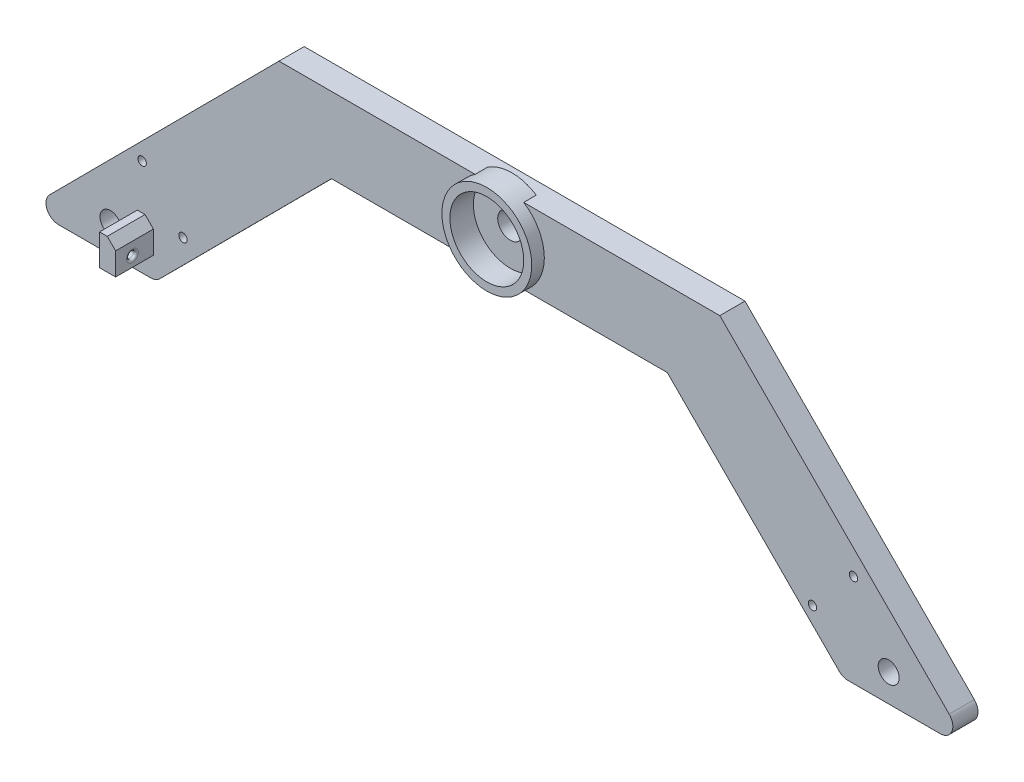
ISO-10303-21;
HEADER;
FILE_DESCRIPTION(('STEP AP214'),'2;1');
FILE_NAME('part.step','',(''),(''),'','','');
FILE_SCHEMA(('AUTOMOTIVE_DESIGN { 1 0 10303 214 1 1 1 1 }'));
ENDSEC;
DATA;
#1=APPLICATION_CONTEXT('core data for automotive mechanical design processes');
#2=APPLICATION_PROTOCOL_DEFINITION('international standard','automotive_design',2000,#1);
#3=PRODUCT_CONTEXT('',#1,'mechanical');
#4=PRODUCT('Part','Part','',(#3));
#5=PRODUCT_RELATED_PRODUCT_CATEGORY('part','',(#4));
#6=PRODUCT_DEFINITION_FORMATION('','',#4);
#7=PRODUCT_DEFINITION_CONTEXT('part definition',#1,'design');
#8=PRODUCT_DEFINITION('design','',#6,#7);
#9=PRODUCT_DEFINITION_SHAPE('','',#8);
#10=(LENGTH_UNIT() NAMED_UNIT(*) SI_UNIT(.MILLI.,.METRE.));
#11=(NAMED_UNIT(*) PLANE_ANGLE_UNIT() SI_UNIT($,.RADIAN.));
#12=(NAMED_UNIT(*) SI_UNIT($,.STERADIAN.) SOLID_ANGLE_UNIT());
#13=UNCERTAINTY_MEASURE_WITH_UNIT(LENGTH_MEASURE(1.E-05),#10,'distance_accuracy_value','');
#14=(GEOMETRIC_REPRESENTATION_CONTEXT(3) GLOBAL_UNCERTAINTY_ASSIGNED_CONTEXT((#13)) GLOBAL_UNIT_ASSIGNED_CONTEXT((#10,
#11,#12)) REPRESENTATION_CONTEXT('',''));
#15=CARTESIAN_POINT('',(0.,0.,0.));
#16=DIRECTION('',(0.,0.,1.));
#17=DIRECTION('',(1.,0.,0.));
#18=AXIS2_PLACEMENT_3D('',#15,#16,#17);
#19=CARTESIAN_POINT('',(-47.8356723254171,-72.890134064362,3.81));
#20=DIRECTION('',(0.,0.,-1.));
#21=DIRECTION('',(-1.,0.,0.));
#22=AXIS2_PLACEMENT_3D('',#19,#20,#21);
#23=PLANE('',#22);
#24=CARTESIAN_POINT('',(-50.4389877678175,-47.3692411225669,3.81));
#25=DIRECTION('',(0.,0.,-1.));
#26=DIRECTION('',(-1.,0.,0.));
#27=AXIS2_PLACEMENT_3D('',#24,#25,#26);
#28=CIRCLE('',#27,1.26999999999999);
#29=CARTESIAN_POINT('',(-51.7089877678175,-47.3692411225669,3.81));
#30=VERTEX_POINT('',#29);
#31=EDGE_CURVE('E511',#30,#30,#28,.T.);
#32=ORIENTED_EDGE('',*,*,#31,.T.);
#33=EDGE_LOOP('',(#32));
#34=FACE_BOUND('',#33,.T.);
#35=CARTESIAN_POINT('',(-38.0964785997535,-61.2527832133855,3.81));
#36=DIRECTION('',(0.,0.,-1.));
#37=DIRECTION('',(-1.,0.,0.));
#38=AXIS2_PLACEMENT_3D('',#35,#36,#37);
#39=CIRCLE('',#38,1.26999999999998);
#40=CARTESIAN_POINT('',(-39.3664785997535,-61.2527832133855,3.81));
#41=VERTEX_POINT('',#40);
#42=EDGE_CURVE('E512',#41,#41,#39,.T.);
#43=ORIENTED_EDGE('',*,*,#42,.T.);
#44=EDGE_LOOP('',(#43));
#45=FACE_BOUND('',#44,.T.);
#46=CARTESIAN_POINT('',(-60.0237244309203,-68.318134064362,3.81));
#47=DIRECTION('',(0.,0.,1.));
#48=DIRECTION('',(1.,0.,0.));
#49=AXIS2_PLACEMENT_3D('',#46,#47,#48);
#50=CIRCLE('',#49,3.175);
#51=CARTESIAN_POINT('',(-56.8487244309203,-68.318134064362,3.81));
#52=VERTEX_POINT('',#51);
#53=EDGE_CURVE('E266',#52,#52,#50,.T.);
#54=ORIENTED_EDGE('',*,*,#53,.F.);
#55=EDGE_LOOP('',(#54));
#56=FACE_BOUND('',#55,.T.);
#57=CARTESIAN_POINT('',(57.6277046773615,-11.930134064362,3.81));
#58=DIRECTION('',(0.,0.,-1.));
#59=DIRECTION('',(-1.,0.,0.));
#60=AXIS2_PLACEMENT_3D('',#57,#58,#59);
#61=CIRCLE('',#60,13.589);
#62=CARTESIAN_POINT('',(50.2781454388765,-0.500134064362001,3.81));
#63=VERTEX_POINT('',#62);
#64=CARTESIAN_POINT('',(50.2926885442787,-23.3694723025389,3.81));
#65=VERTEX_POINT('',#64);
#66=EDGE_CURVE('E345',#63,#65,#61,.F.);
#67=ORIENTED_EDGE('',*,*,#66,.F.);
#68=DIRECTION('',(1.,0.,0.));
#69=VECTOR('',#68,1.);
#70=CARTESIAN_POINT('',(-9.04809358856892,-0.500134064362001,3.81));
#71=LINE('',#70,#69);
#72=CARTESIAN_POINT('',(-9.04809358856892,-0.500134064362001,3.81));
#73=VERTEX_POINT('',#72);
#74=EDGE_CURVE('E290',#73,#63,#71,.T.);
#75=ORIENTED_EDGE('',*,*,#74,.F.);
#76=DIRECTION('',(0.7054389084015,0.708770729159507,0.));
#77=VECTOR('',#76,1.);
#78=CARTESIAN_POINT('',(-78.4227118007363,-70.2024118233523,3.81));
#79=LINE('',#78,#77);
#80=CARTESIAN_POINT('',(-78.4227118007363,-70.2024118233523,3.81));
#81=VERTEX_POINT('',#80);
#82=EDGE_CURVE('E286',#81,#73,#79,.T.);
#83=ORIENTED_EDGE('',*,*,#82,.F.);
#84=CARTESIAN_POINT('',(-75.7222953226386,-72.890134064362,3.81));
#85=DIRECTION('',(0.,0.,-1.));
#86=DIRECTION('',(-1.,0.,0.));
#87=AXIS2_PLACEMENT_3D('',#84,#85,#86);
#88=CIRCLE('',#87,3.80999999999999);
#89=CARTESIAN_POINT('',(-75.7222953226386,-76.700134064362,3.81));
#90=VERTEX_POINT('',#89);
#91=EDGE_CURVE('E283',#90,#81,#88,.T.);
#92=ORIENTED_EDGE('',*,*,#91,.F.);
#93=DIRECTION('',(1.,0.,0.));
#94=VECTOR('',#93,1.);
#95=CARTESIAN_POINT('',(-75.7222953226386,-76.700134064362,3.81));
#96=LINE('',#95,#94);
#97=CARTESIAN_POINT('',(-47.8356723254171,-76.700134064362,3.81));
#98=VERTEX_POINT('',#97);
#99=EDGE_CURVE('E281',#90,#98,#96,.T.);
#100=ORIENTED_EDGE('',*,*,#99,.T.);
#101=CARTESIAN_POINT('',(-47.8356723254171,-72.890134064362,3.81));
#102=DIRECTION('',(0.,0.,-1.));
#103=DIRECTION('',(-1.,0.,0.));
#104=AXIS2_PLACEMENT_3D('',#101,#102,#103);
#105=CIRCLE('',#104,3.81000000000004);
#106=CARTESIAN_POINT('',(-45.1352558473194,-75.5778563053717,3.81));
#107=VERTEX_POINT('',#106);
#108=EDGE_CURVE('E277',#107,#98,#105,.T.);
#109=ORIENTED_EDGE('',*,*,#108,.F.);
#110=DIRECTION('',(-0.7054389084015,-0.708770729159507,0.));
#111=VECTOR('',#110,1.);
#112=CARTESIAN_POINT('',(6.82770467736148,-23.3694723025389,3.81));
#113=LINE('',#112,#111);
#114=CARTESIAN_POINT('',(6.82770467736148,-23.3694723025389,3.81));
#115=VERTEX_POINT('',#114);
#116=EDGE_CURVE('E274',#115,#107,#113,.T.);
#117=ORIENTED_EDGE('',*,*,#116,.F.);
#118=DIRECTION('',(1.,0.,0.));
#119=VECTOR('',#118,1.);
#120=CARTESIAN_POINT('',(6.82770467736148,-23.3694723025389,3.81));
#121=LINE('',#120,#119);
#122=EDGE_CURVE('E307',#115,#65,#121,.T.);
#123=ORIENTED_EDGE('',*,*,#122,.T.);
#124=EDGE_LOOP('',(#67,#75,#83,#92,#100,#109,#117,#123));
#125=FACE_BOUND('',#124,.T.);
#126=DIRECTION('',(0.,1.,0.));
#127=VECTOR('',#126,1.);
#128=CARTESIAN_POINT('',(-47.0360925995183,-60.952134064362,3.81));
#129=LINE('',#128,#127);
#130=CARTESIAN_POINT('',(-47.0360925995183,-70.350134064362,3.81));
#131=VERTEX_POINT('',#130);
#132=CARTESIAN_POINT('',(-47.0360925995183,-63.492134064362,3.81));
#133=VERTEX_POINT('',#132);
#134=EDGE_CURVE('E220',#131,#133,#129,.T.);
#135=ORIENTED_EDGE('',*,*,#134,.F.);
#136=DIRECTION('',(1.,0.,0.));
#137=VECTOR('',#136,1.);
#138=CARTESIAN_POINT('',(-47.0360925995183,-70.350134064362,3.81));
#139=LINE('',#138,#137);
#140=CARTESIAN_POINT('',(-51.8957244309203,-70.350134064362,3.81));
#141=VERTEX_POINT('',#140);
#142=EDGE_CURVE('E226',#141,#131,#139,.T.);
#143=ORIENTED_EDGE('',*,*,#142,.F.);
#144=DIRECTION('',(0.,-1.,0.));
#145=VECTOR('',#144,1.);
#146=CARTESIAN_POINT('',(-51.8957244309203,-60.952134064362,3.81));
#147=LINE('',#146,#145);
#148=CARTESIAN_POINT('',(-51.8957244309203,-60.952134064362,3.81));
#149=VERTEX_POINT('',#148);
#150=EDGE_CURVE('E224',#149,#141,#147,.T.);
#151=ORIENTED_EDGE('',*,*,#150,.F.);
#152=DIRECTION('',(-1.,0.,0.));
#153=VECTOR('',#152,1.);
#154=CARTESIAN_POINT('',(-47.0360925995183,-60.952134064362,3.81));
#155=LINE('',#154,#153);
#156=CARTESIAN_POINT('',(-49.5760925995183,-60.952134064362,3.81));
#157=VERTEX_POINT('',#156);
#158=EDGE_CURVE('E204',#157,#149,#155,.T.);
#159=ORIENTED_EDGE('',*,*,#158,.F.);
#160=DIRECTION('',(-0.707106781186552,0.707106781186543,0.));
#161=VECTOR('',#160,1.);
#162=CARTESIAN_POINT('',(-42.7368824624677,-67.7913442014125,3.81));
#163=LINE('',#162,#161);
#164=EDGE_CURVE('E68',#157,#133,#163,.F.);
#165=ORIENTED_EDGE('',*,*,#164,.T.);
#166=EDGE_LOOP('',(#135,#143,#151,#159,#165));
#167=FACE_BOUND('',#166,.T.);
#168=ADVANCED_FACE('F45',(#34,#45,#56,#125,#167),#23,.F.);
#169=CARTESIAN_POINT('',(57.6277046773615,-11.930134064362,-14.586307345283));
#170=DIRECTION('',(0.,0.,1.));
#171=DIRECTION('',(1.,0.,0.));
#172=AXIS2_PLACEMENT_3D('',#169,#170,#171);
#173=CYLINDRICAL_SURFACE('',#172,3.81);
#174=CARTESIAN_POINT('',(57.6277046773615,-11.930134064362,-3.81));
#175=DIRECTION('',(0.,0.,-1.));
#176=DIRECTION('',(-1.,0.,0.));
#177=AXIS2_PLACEMENT_3D('',#174,#175,#176);
#178=CIRCLE('',#177,3.81);
#179=CARTESIAN_POINT('',(53.8177046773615,-11.930134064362,-3.81));
#180=VERTEX_POINT('',#179);
#181=EDGE_CURVE('E238',#180,#180,#178,.F.);
#182=ORIENTED_EDGE('',*,*,#181,.F.);
#183=EDGE_LOOP('',(#182));
#184=FACE_BOUND('',#183,.T.);
#185=CARTESIAN_POINT('',(57.6277046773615,-11.930134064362,0.507999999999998));
#186=DIRECTION('',(0.,0.,1.));
#187=DIRECTION('',(1.,0.,0.));
#188=AXIS2_PLACEMENT_3D('',#185,#186,#187);
#189=CIRCLE('',#188,3.81);
#190=CARTESIAN_POINT('',(61.4377046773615,-11.930134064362,0.507999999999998));
#191=VERTEX_POINT('',#190);
#192=EDGE_CURVE('E235',#191,#191,#189,.F.);
#193=ORIENTED_EDGE('',*,*,#192,.F.);
#194=EDGE_LOOP('',(#193));
#195=FACE_BOUND('',#194,.T.);
#196=ADVANCED_FACE('F402',(#184,#195),#173,.F.);
#197=CARTESIAN_POINT('',(6.82770467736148,-23.3694723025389,3.81));
#198=DIRECTION('',(0.,1.,0.));
#199=DIRECTION('',(0.,0.,1.));
#200=AXIS2_PLACEMENT_3D('',#197,#198,#199);
#201=PLANE('',#200);
#202=DIRECTION('',(0.,0.,-1.));
#203=VECTOR('',#202,1.);
#204=CARTESIAN_POINT('',(64.9627208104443,-23.3694723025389,7.62));
#205=LINE('',#204,#203);
#206=CARTESIAN_POINT('',(64.9627208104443,-23.3694723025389,0.));
#207=VERTEX_POINT('',#206);
#208=CARTESIAN_POINT('',(64.9627208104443,-23.3694723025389,3.81));
#209=VERTEX_POINT('',#208);
#210=EDGE_CURVE('E255',#207,#209,#205,.F.);
#211=ORIENTED_EDGE('',*,*,#210,.F.);
#212=DIRECTION('',(1.,0.,0.));
#213=VECTOR('',#212,1.);
#214=CARTESIAN_POINT('',(6.82770467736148,-23.3694723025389,0.));
#215=LINE('',#214,#213);
#216=CARTESIAN_POINT('',(50.2926885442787,-23.3694723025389,0.));
#217=VERTEX_POINT('',#216);
#218=EDGE_CURVE('E258',#217,#207,#215,.T.);
#219=ORIENTED_EDGE('',*,*,#218,.F.);
#220=DIRECTION('',(0.,0.,-1.));
#221=VECTOR('',#220,1.);
#222=CARTESIAN_POINT('',(50.2926885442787,-23.3694723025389,7.62));
#223=LINE('',#222,#221);
#224=EDGE_CURVE('E250',#65,#217,#223,.T.);
#225=ORIENTED_EDGE('',*,*,#224,.F.);
#226=ORIENTED_EDGE('',*,*,#122,.F.);
#227=DIRECTION('',(0.,0.,-1.));
#228=VECTOR('',#227,1.);
#229=CARTESIAN_POINT('',(6.82770467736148,-23.3694723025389,3.81));
#230=LINE('',#229,#228);
#231=CARTESIAN_POINT('',(6.82770467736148,-23.3694723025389,-3.81));
#232=VERTEX_POINT('',#231);
#233=EDGE_CURVE('E343',#115,#232,#230,.T.);
#234=ORIENTED_EDGE('',*,*,#233,.T.);
#235=DIRECTION('',(1.,0.,0.));
#236=VECTOR('',#235,1.);
#237=CARTESIAN_POINT('',(6.82770467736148,-23.3694723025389,-3.81));
#238=LINE('',#237,#236);
#239=CARTESIAN_POINT('',(108.427704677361,-23.3694723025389,-3.81));
#240=VERTEX_POINT('',#239);
#241=EDGE_CURVE('E278',#232,#240,#238,.T.);
#242=ORIENTED_EDGE('',*,*,#241,.T.);
#243=DIRECTION('',(0.,0.,-1.));
#244=VECTOR('',#243,1.);
#245=CARTESIAN_POINT('',(108.427704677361,-23.3694723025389,3.81));
#246=LINE('',#245,#244);
#247=CARTESIAN_POINT('',(108.427704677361,-23.3694723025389,3.81));
#248=VERTEX_POINT('',#247);
#249=EDGE_CURVE('E346',#248,#240,#246,.T.);
#250=ORIENTED_EDGE('',*,*,#249,.F.);
#251=EDGE_CURVE('E306',#209,#248,#121,.T.);
#252=ORIENTED_EDGE('',*,*,#251,.F.);
#253=EDGE_LOOP('',(#211,#219,#225,#226,#234,#242,#250,#252));
#254=FACE_BOUND('',#253,.T.);
#255=ADVANCED_FACE('F410',(#254),#201,.F.);
#256=CARTESIAN_POINT('',(-9.04809358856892,-0.500134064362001,3.81));
#257=DIRECTION('',(0.,1.,0.));
#258=DIRECTION('',(0.,0.,1.));
#259=AXIS2_PLACEMENT_3D('',#256,#257,#258);
#260=PLANE('',#259);
#261=DIRECTION('',(1.,0.,0.));
#262=VECTOR('',#261,1.);
#263=CARTESIAN_POINT('',(-9.04809358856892,-0.500134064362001,0.));
#264=LINE('',#263,#262);
#265=CARTESIAN_POINT('',(50.2781454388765,-0.500134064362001,0.));
#266=VERTEX_POINT('',#265);
#267=CARTESIAN_POINT('',(64.9772639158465,-0.500134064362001,0.));
#268=VERTEX_POINT('',#267);
#269=EDGE_CURVE('E371',#266,#268,#264,.T.);
#270=ORIENTED_EDGE('',*,*,#269,.T.);
#271=DIRECTION('',(0.,0.,-1.));
#272=VECTOR('',#271,1.);
#273=CARTESIAN_POINT('',(64.9772639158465,-0.500134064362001,7.62));
#274=LINE('',#273,#272);
#275=CARTESIAN_POINT('',(64.9772639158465,-0.500134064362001,3.81));
#276=VERTEX_POINT('',#275);
#277=EDGE_CURVE('E253',#268,#276,#274,.F.);
#278=ORIENTED_EDGE('',*,*,#277,.T.);
#279=CARTESIAN_POINT('',(124.303502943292,-0.500134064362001,3.81));
#280=VERTEX_POINT('',#279);
#281=EDGE_CURVE('E289',#276,#280,#71,.T.);
#282=ORIENTED_EDGE('',*,*,#281,.T.);
#283=DIRECTION('',(0.,0.,-1.));
#284=VECTOR('',#283,1.);
#285=CARTESIAN_POINT('',(124.303502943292,-0.500134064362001,3.81));
#286=LINE('',#285,#284);
#287=CARTESIAN_POINT('',(124.303502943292,-0.500134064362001,-3.81));
#288=VERTEX_POINT('',#287);
#289=EDGE_CURVE('E357',#280,#288,#286,.T.);
#290=ORIENTED_EDGE('',*,*,#289,.T.);
#291=DIRECTION('',(1.,0.,0.));
#292=VECTOR('',#291,1.);
#293=CARTESIAN_POINT('',(-9.04809358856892,-0.500134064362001,-3.81));
#294=LINE('',#293,#292);
#295=CARTESIAN_POINT('',(-9.04809358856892,-0.500134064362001,-3.81));
#296=VERTEX_POINT('',#295);
#297=EDGE_CURVE('E324',#296,#288,#294,.T.);
#298=ORIENTED_EDGE('',*,*,#297,.F.);
#299=DIRECTION('',(0.,0.,-1.));
#300=VECTOR('',#299,1.);
#301=CARTESIAN_POINT('',(-9.04809358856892,-0.500134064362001,3.81));
#302=LINE('',#301,#300);
#303=EDGE_CURVE('E359',#73,#296,#302,.T.);
#304=ORIENTED_EDGE('',*,*,#303,.F.);
#305=ORIENTED_EDGE('',*,*,#74,.T.);
#306=DIRECTION('',(0.,0.,-1.));
#307=VECTOR('',#306,1.);
#308=CARTESIAN_POINT('',(50.2781454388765,-0.500134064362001,7.62));
#309=LINE('',#308,#307);
#310=EDGE_CURVE('E245',#63,#266,#309,.T.);
#311=ORIENTED_EDGE('',*,*,#310,.T.);
#312=EDGE_LOOP('',(#270,#278,#282,#290,#298,#304,#305,#311));
#313=FACE_BOUND('',#312,.T.);
#314=ADVANCED_FACE('F418',(#313),#260,.T.);
#315=CARTESIAN_POINT('',(152.332770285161,-62.4325460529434,3.81));
#316=DIRECTION('',(0.,0.,-1.));
#317=DIRECTION('',(-1.,0.,0.));
#318=AXIS2_PLACEMENT_3D('',#315,#316,#317);
#319=CIRCLE('',#318,1.27000000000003);
#320=CARTESIAN_POINT('',(151.062770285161,-62.4325460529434,3.81));
#321=VERTEX_POINT('',#320);
#322=EDGE_CURVE('E381',#321,#321,#319,.T.);
#323=ORIENTED_EDGE('',*,*,#322,.T.);
#324=EDGE_LOOP('',(#323));
#325=FACE_BOUND('',#324,.T.);
#326=CARTESIAN_POINT('',(164.742332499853,-48.6163737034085,3.81));
#327=DIRECTION('',(0.,0.,-1.));
#328=DIRECTION('',(-1.,0.,0.));
#329=AXIS2_PLACEMENT_3D('',#326,#327,#328);
#330=CIRCLE('',#329,1.26999999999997);
#331=CARTESIAN_POINT('',(163.472332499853,-48.6163737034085,3.81));
#332=VERTEX_POINT('',#331);
#333=EDGE_CURVE('E436',#332,#332,#330,.T.);
#334=ORIENTED_EDGE('',*,*,#333,.T.);
#335=EDGE_LOOP('',(#334));
#336=FACE_BOUND('',#335,.T.);
#337=EDGE_CURVE('E370',#209,#276,#61,.F.);
#338=ORIENTED_EDGE('',*,*,#337,.F.);
#339=ORIENTED_EDGE('',*,*,#251,.T.);
#340=DIRECTION('',(-0.7054389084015,0.708770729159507,0.));
#341=VECTOR('',#340,1.);
#342=CARTESIAN_POINT('',(160.390665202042,-75.5778563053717,3.81));
#343=LINE('',#342,#341);
#344=CARTESIAN_POINT('',(160.390665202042,-75.5778563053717,3.81));
#345=VERTEX_POINT('',#344);
#346=EDGE_CURVE('E303',#345,#248,#343,.T.);
#347=ORIENTED_EDGE('',*,*,#346,.F.);
#348=CARTESIAN_POINT('',(163.09108168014,-72.890134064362,3.81));
#349=DIRECTION('',(0.,0.,1.));
#350=DIRECTION('',(1.,0.,0.));
#351=AXIS2_PLACEMENT_3D('',#348,#349,#350);
#352=CIRCLE('',#351,3.81000000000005);
#353=CARTESIAN_POINT('',(163.09108168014,-76.700134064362,3.81));
#354=VERTEX_POINT('',#353);
#355=EDGE_CURVE('E301',#345,#354,#352,.T.);
#356=ORIENTED_EDGE('',*,*,#355,.T.);
#357=DIRECTION('',(-1.,0.,0.));
#358=VECTOR('',#357,1.);
#359=CARTESIAN_POINT('',(190.977704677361,-76.700134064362,3.81));
#360=LINE('',#359,#358);
#361=CARTESIAN_POINT('',(190.977704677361,-76.700134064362,3.81));
#362=VERTEX_POINT('',#361);
#363=EDGE_CURVE('E298',#362,#354,#360,.T.);
#364=ORIENTED_EDGE('',*,*,#363,.F.);
#365=CARTESIAN_POINT('',(190.977704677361,-72.890134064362,3.81));
#366=DIRECTION('',(0.,0.,1.));
#367=DIRECTION('',(1.,0.,0.));
#368=AXIS2_PLACEMENT_3D('',#365,#366,#367);
#369=CIRCLE('',#368,3.81000000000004);
#370=CARTESIAN_POINT('',(193.678121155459,-70.2024118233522,3.81));
#371=VERTEX_POINT('',#370);
#372=EDGE_CURVE('E296',#362,#371,#369,.T.);
#373=ORIENTED_EDGE('',*,*,#372,.T.);
#374=DIRECTION('',(-0.7054389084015,0.708770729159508,0.));
#375=VECTOR('',#374,1.);
#376=CARTESIAN_POINT('',(193.678121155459,-70.2024118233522,3.81));
#377=LINE('',#376,#375);
#378=EDGE_CURVE('E293',#371,#280,#377,.T.);
#379=ORIENTED_EDGE('',*,*,#378,.T.);
#380=ORIENTED_EDGE('',*,*,#281,.F.);
#381=EDGE_LOOP('',(#338,#339,#347,#356,#364,#373,#379,#380));
#382=FACE_BOUND('',#381,.T.);
#383=CARTESIAN_POINT('',(175.383820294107,-68.318134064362,3.81));
#384=DIRECTION('',(0.,0.,1.));
#385=DIRECTION('',(1.,0.,0.));
#386=AXIS2_PLACEMENT_3D('',#383,#384,#385);
#387=CIRCLE('',#386,3.175);
#388=CARTESIAN_POINT('',(178.558820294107,-68.318134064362,3.81));
#389=VERTEX_POINT('',#388);
#390=EDGE_CURVE('E269',#389,#389,#387,.T.);
#391=ORIENTED_EDGE('',*,*,#390,.F.);
#392=EDGE_LOOP('',(#391));
#393=FACE_BOUND('',#392,.T.);
#394=ADVANCED_FACE('F405',(#325,#336,#382,#393),#23,.F.);
#395=CARTESIAN_POINT('',(6.82770467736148,-23.3694723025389,3.81));
#396=DIRECTION('',(0.708770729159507,-0.7054389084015,0.));
#397=DIRECTION('',(0.7054389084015,0.708770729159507,0.));
#398=AXIS2_PLACEMENT_3D('',#395,#396,#397);
#399=PLANE('',#398);
#400=DIRECTION('',(-0.7054389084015,-0.708770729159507,0.));
#401=VECTOR('',#400,1.);
#402=CARTESIAN_POINT('',(6.82770467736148,-23.3694723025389,-3.81));
#403=LINE('',#402,#401);
#404=CARTESIAN_POINT('',(-45.1352558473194,-75.5778563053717,-3.81));
#405=VERTEX_POINT('',#404);
#406=EDGE_CURVE('E265',#232,#405,#403,.T.);
#407=ORIENTED_EDGE('',*,*,#406,.F.);
#408=ORIENTED_EDGE('',*,*,#233,.F.);
#409=ORIENTED_EDGE('',*,*,#116,.T.);
#410=DIRECTION('',(0.,0.,-1.));
#411=VECTOR('',#410,1.);
#412=CARTESIAN_POINT('',(-45.1352558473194,-75.5778563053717,3.81));
#413=LINE('',#412,#411);
#414=EDGE_CURVE('E309',#107,#405,#413,.T.);
#415=ORIENTED_EDGE('',*,*,#414,.T.);
#416=EDGE_LOOP('',(#407,#408,#409,#415));
#417=FACE_BOUND('',#416,.T.);
#418=ADVANCED_FACE('F417',(#417),#399,.T.);
#419=CARTESIAN_POINT('',(160.390665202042,-75.5778563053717,3.81));
#420=DIRECTION('',(-0.708770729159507,-0.7054389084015,0.));
#421=DIRECTION('',(0.7054389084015,-0.708770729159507,0.));
#422=AXIS2_PLACEMENT_3D('',#419,#420,#421);
#423=PLANE('',#422);
#424=DIRECTION('',(-0.7054389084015,0.708770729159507,0.));
#425=VECTOR('',#424,1.);
#426=CARTESIAN_POINT('',(160.390665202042,-75.5778563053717,-3.81));
#427=LINE('',#426,#425);
#428=CARTESIAN_POINT('',(160.390665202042,-75.5778563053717,-3.81));
#429=VERTEX_POINT('',#428);
#430=EDGE_CURVE('E338',#429,#240,#427,.T.);
#431=ORIENTED_EDGE('',*,*,#430,.F.);
#432=DIRECTION('',(0.,0.,-1.));
#433=VECTOR('',#432,1.);
#434=CARTESIAN_POINT('',(160.390665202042,-75.5778563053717,3.81));
#435=LINE('',#434,#433);
#436=EDGE_CURVE('E348',#345,#429,#435,.T.);
#437=ORIENTED_EDGE('',*,*,#436,.F.);
#438=ORIENTED_EDGE('',*,*,#346,.T.);
#439=ORIENTED_EDGE('',*,*,#249,.T.);
#440=EDGE_LOOP('',(#431,#437,#438,#439));
#441=FACE_BOUND('',#440,.T.);
#442=ADVANCED_FACE('F424',(#441),#423,.T.);
#443=CARTESIAN_POINT('',(163.09108168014,-72.890134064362,3.81));
#444=DIRECTION('',(0.,0.,-1.));
#445=DIRECTION('',(-1.,0.,0.));
#446=AXIS2_PLACEMENT_3D('',#443,#444,#445);
#447=CYLINDRICAL_SURFACE('',#446,3.81000000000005);
#448=CARTESIAN_POINT('',(163.09108168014,-72.890134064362,-3.81));
#449=DIRECTION('',(0.,0.,1.));
#450=DIRECTION('',(1.,0.,0.));
#451=AXIS2_PLACEMENT_3D('',#448,#449,#450);
#452=CIRCLE('',#451,3.81000000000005);
#453=CARTESIAN_POINT('',(163.09108168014,-76.700134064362,-3.81));
#454=VERTEX_POINT('',#453);
#455=EDGE_CURVE('E335',#429,#454,#452,.T.);
#456=ORIENTED_EDGE('',*,*,#455,.T.);
#457=DIRECTION('',(0.,0.,-1.));
#458=VECTOR('',#457,1.);
#459=CARTESIAN_POINT('',(163.09108168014,-76.700134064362,3.81));
#460=LINE('',#459,#458);
#461=EDGE_CURVE('E350',#354,#454,#460,.T.);
#462=ORIENTED_EDGE('',*,*,#461,.F.);
#463=ORIENTED_EDGE('',*,*,#355,.F.);
#464=ORIENTED_EDGE('',*,*,#436,.T.);
#465=EDGE_LOOP('',(#456,#462,#463,#464));
#466=FACE_BOUND('',#465,.T.);
#467=ADVANCED_FACE('F554',(#466),#447,.T.);
#468=CARTESIAN_POINT('',(190.977704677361,-76.700134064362,3.81));
#469=DIRECTION('',(0.,-1.,0.));
#470=DIRECTION('',(1.,0.,0.));
#471=AXIS2_PLACEMENT_3D('',#468,#469,#470);
#472=PLANE('',#471);
#473=DIRECTION('',(-1.,0.,0.));
#474=VECTOR('',#473,1.);
#475=CARTESIAN_POINT('',(190.977704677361,-76.700134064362,-3.81));
#476=LINE('',#475,#474);
#477=CARTESIAN_POINT('',(190.977704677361,-76.700134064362,-3.81));
#478=VERTEX_POINT('',#477);
#479=EDGE_CURVE('E332',#478,#454,#476,.T.);
#480=ORIENTED_EDGE('',*,*,#479,.F.);
#481=DIRECTION('',(0.,0.,-1.));
#482=VECTOR('',#481,1.);
#483=CARTESIAN_POINT('',(190.977704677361,-76.700134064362,3.81));
#484=LINE('',#483,#482);
#485=EDGE_CURVE('E352',#362,#478,#484,.T.);
#486=ORIENTED_EDGE('',*,*,#485,.F.);
#487=ORIENTED_EDGE('',*,*,#363,.T.);
#488=ORIENTED_EDGE('',*,*,#461,.T.);
#489=EDGE_LOOP('',(#480,#486,#487,#488));
#490=FACE_BOUND('',#489,.T.);
#491=ADVANCED_FACE('F550',(#490),#472,.T.);
#492=CARTESIAN_POINT('',(190.977704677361,-72.890134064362,3.81));
#493=DIRECTION('',(0.,0.,-1.));
#494=DIRECTION('',(-1.,0.,0.));
#495=AXIS2_PLACEMENT_3D('',#492,#493,#494);
#496=CYLINDRICAL_SURFACE('',#495,3.81000000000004);
#497=CARTESIAN_POINT('',(190.977704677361,-72.890134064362,-3.81));
#498=DIRECTION('',(0.,0.,1.));
#499=DIRECTION('',(1.,0.,0.));
#500=AXIS2_PLACEMENT_3D('',#497,#498,#499);
#501=CIRCLE('',#500,3.81000000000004);
#502=CARTESIAN_POINT('',(193.678121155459,-70.2024118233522,-3.81));
#503=VERTEX_POINT('',#502);
#504=EDGE_CURVE('E330',#478,#503,#501,.T.);
#505=ORIENTED_EDGE('',*,*,#504,.T.);
#506=DIRECTION('',(0.,0.,-1.));
#507=VECTOR('',#506,1.);
#508=CARTESIAN_POINT('',(193.678121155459,-70.2024118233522,3.81));
#509=LINE('',#508,#507);
#510=EDGE_CURVE('E354',#371,#503,#509,.T.);
#511=ORIENTED_EDGE('',*,*,#510,.F.);
#512=ORIENTED_EDGE('',*,*,#372,.F.);
#513=ORIENTED_EDGE('',*,*,#485,.T.);
#514=EDGE_LOOP('',(#505,#511,#512,#513));
#515=FACE_BOUND('',#514,.T.);
#516=ADVANCED_FACE('F546',(#515),#496,.T.);
#517=CARTESIAN_POINT('',(193.678121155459,-70.2024118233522,3.81));
#518=DIRECTION('',(-0.708770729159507,-0.7054389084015,0.));
#519=DIRECTION('',(0.7054389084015,-0.708770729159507,0.));
#520=AXIS2_PLACEMENT_3D('',#517,#518,#519);
#521=PLANE('',#520);
#522=DIRECTION('',(-0.7054389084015,0.708770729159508,0.));
#523=VECTOR('',#522,1.);
#524=CARTESIAN_POINT('',(193.678121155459,-70.2024118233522,-3.81));
#525=LINE('',#524,#523);
#526=EDGE_CURVE('E327',#503,#288,#525,.T.);
#527=ORIENTED_EDGE('',*,*,#526,.T.);
#528=ORIENTED_EDGE('',*,*,#289,.F.);
#529=ORIENTED_EDGE('',*,*,#378,.F.);
#530=ORIENTED_EDGE('',*,*,#510,.T.);
#531=EDGE_LOOP('',(#527,#528,#529,#530));
#532=FACE_BOUND('',#531,.T.);
#533=ADVANCED_FACE('F541',(#532),#521,.F.);
#534=CARTESIAN_POINT('',(-78.4227118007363,-70.2024118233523,3.81));
#535=DIRECTION('',(-0.708770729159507,0.7054389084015,0.));
#536=DIRECTION('',(-0.7054389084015,-0.708770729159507,0.));
#537=AXIS2_PLACEMENT_3D('',#534,#535,#536);
#538=PLANE('',#537);
#539=DIRECTION('',(0.7054389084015,0.708770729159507,0.));
#540=VECTOR('',#539,1.);
#541=CARTESIAN_POINT('',(-78.4227118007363,-70.2024118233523,-3.81));
#542=LINE('',#541,#540);
#543=CARTESIAN_POINT('',(-78.4227118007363,-70.2024118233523,-3.81));
#544=VERTEX_POINT('',#543);
#545=EDGE_CURVE('E321',#544,#296,#542,.T.);
#546=ORIENTED_EDGE('',*,*,#545,.F.);
#547=DIRECTION('',(0.,0.,-1.));
#548=VECTOR('',#547,1.);
#549=CARTESIAN_POINT('',(-78.4227118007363,-70.2024118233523,3.81));
#550=LINE('',#549,#548);
#551=EDGE_CURVE('E361',#81,#544,#550,.T.);
#552=ORIENTED_EDGE('',*,*,#551,.F.);
#553=ORIENTED_EDGE('',*,*,#82,.T.);
#554=ORIENTED_EDGE('',*,*,#303,.T.);
#555=EDGE_LOOP('',(#546,#552,#553,#554));
#556=FACE_BOUND('',#555,.T.);
#557=ADVANCED_FACE('F538',(#556),#538,.T.);
#558=CARTESIAN_POINT('',(-75.7222953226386,-72.890134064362,3.81));
#559=DIRECTION('',(0.,0.,-1.));
#560=DIRECTION('',(-1.,0.,0.));
#561=AXIS2_PLACEMENT_3D('',#558,#559,#560);
#562=CYLINDRICAL_SURFACE('',#561,3.80999999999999);
#563=CARTESIAN_POINT('',(-75.7222953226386,-72.890134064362,-3.81));
#564=DIRECTION('',(0.,0.,-1.));
#565=DIRECTION('',(-1.,0.,0.));
#566=AXIS2_PLACEMENT_3D('',#563,#564,#565);
#567=CIRCLE('',#566,3.80999999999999);
#568=CARTESIAN_POINT('',(-75.7222953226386,-76.700134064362,-3.81));
#569=VERTEX_POINT('',#568);
#570=EDGE_CURVE('E318',#569,#544,#567,.T.);
#571=ORIENTED_EDGE('',*,*,#570,.F.);
#572=DIRECTION('',(0.,0.,-1.));
#573=VECTOR('',#572,1.);
#574=CARTESIAN_POINT('',(-75.7222953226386,-76.700134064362,3.81));
#575=LINE('',#574,#573);
#576=EDGE_CURVE('E363',#90,#569,#575,.T.);
#577=ORIENTED_EDGE('',*,*,#576,.F.);
#578=ORIENTED_EDGE('',*,*,#91,.T.);
#579=ORIENTED_EDGE('',*,*,#551,.T.);
#580=EDGE_LOOP('',(#571,#577,#578,#579));
#581=FACE_BOUND('',#580,.T.);
#582=ADVANCED_FACE('F534',(#581),#562,.T.);
#583=CARTESIAN_POINT('',(-75.7222953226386,-76.700134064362,3.81));
#584=DIRECTION('',(0.,1.,0.));
#585=DIRECTION('',(-1.,0.,0.));
#586=AXIS2_PLACEMENT_3D('',#583,#584,#585);
#587=PLANE('',#586);
#588=DIRECTION('',(1.,0.,0.));
#589=VECTOR('',#588,1.);
#590=CARTESIAN_POINT('',(-75.7222953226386,-76.700134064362,-3.81));
#591=LINE('',#590,#589);
#592=CARTESIAN_POINT('',(-47.8356723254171,-76.700134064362,-3.81));
#593=VERTEX_POINT('',#592);
#594=EDGE_CURVE('E315',#569,#593,#591,.T.);
#595=ORIENTED_EDGE('',*,*,#594,.T.);
#596=DIRECTION('',(0.,0.,-1.));
#597=VECTOR('',#596,1.);
#598=CARTESIAN_POINT('',(-47.8356723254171,-76.700134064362,3.81));
#599=LINE('',#598,#597);
#600=EDGE_CURVE('E365',#98,#593,#599,.T.);
#601=ORIENTED_EDGE('',*,*,#600,.F.);
#602=ORIENTED_EDGE('',*,*,#99,.F.);
#603=ORIENTED_EDGE('',*,*,#576,.T.);
#604=EDGE_LOOP('',(#595,#601,#602,#603));
#605=FACE_BOUND('',#604,.T.);
#606=ADVANCED_FACE('F530',(#605),#587,.F.);
#607=CARTESIAN_POINT('',(-47.8356723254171,-72.890134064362,3.81));
#608=DIRECTION('',(0.,0.,-1.));
#609=DIRECTION('',(-1.,0.,0.));
#610=AXIS2_PLACEMENT_3D('',#607,#608,#609);
#611=CYLINDRICAL_SURFACE('',#610,3.81000000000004);
#612=CARTESIAN_POINT('',(-47.8356723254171,-72.890134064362,-3.81));
#613=DIRECTION('',(0.,0.,-1.));
#614=DIRECTION('',(-1.,0.,0.));
#615=AXIS2_PLACEMENT_3D('',#612,#613,#614);
#616=CIRCLE('',#615,3.81000000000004);
#617=EDGE_CURVE('E312',#405,#593,#616,.T.);
#618=ORIENTED_EDGE('',*,*,#617,.F.);
#619=ORIENTED_EDGE('',*,*,#414,.F.);
#620=ORIENTED_EDGE('',*,*,#108,.T.);
#621=ORIENTED_EDGE('',*,*,#600,.T.);
#622=EDGE_LOOP('',(#618,#619,#620,#621));
#623=FACE_BOUND('',#622,.T.);
#624=ADVANCED_FACE('F455',(#623),#611,.T.);
#625=CARTESIAN_POINT('',(-47.8356723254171,-72.890134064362,-3.81));
#626=DIRECTION('',(0.,0.,-1.));
#627=DIRECTION('',(-1.,0.,0.));
#628=AXIS2_PLACEMENT_3D('',#625,#626,#627);
#629=PLANE('',#628);
#630=CARTESIAN_POINT('',(152.332770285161,-62.4325460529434,-3.81));
#631=DIRECTION('',(0.,0.,-1.));
#632=DIRECTION('',(-1.,0.,0.));
#633=AXIS2_PLACEMENT_3D('',#630,#631,#632);
#634=CIRCLE('',#633,1.27000000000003);
#635=CARTESIAN_POINT('',(151.062770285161,-62.4325460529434,-3.81));
#636=VERTEX_POINT('',#635);
#637=EDGE_CURVE('E811',#636,#636,#634,.T.);
#638=ORIENTED_EDGE('',*,*,#637,.F.);
#639=EDGE_LOOP('',(#638));
#640=FACE_BOUND('',#639,.T.);
#641=CARTESIAN_POINT('',(164.742332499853,-48.6163737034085,-3.81));
#642=DIRECTION('',(0.,0.,-1.));
#643=DIRECTION('',(-1.,0.,0.));
#644=AXIS2_PLACEMENT_3D('',#641,#642,#643);
#645=CIRCLE('',#644,1.26999999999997);
#646=CARTESIAN_POINT('',(163.472332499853,-48.6163737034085,-3.81));
#647=VERTEX_POINT('',#646);
#648=EDGE_CURVE('E814',#647,#647,#645,.T.);
#649=ORIENTED_EDGE('',*,*,#648,.F.);
#650=EDGE_LOOP('',(#649));
#651=FACE_BOUND('',#650,.T.);
#652=CARTESIAN_POINT('',(-50.4389877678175,-47.3692411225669,-3.81));
#653=DIRECTION('',(0.,0.,-1.));
#654=DIRECTION('',(-1.,0.,0.));
#655=AXIS2_PLACEMENT_3D('',#652,#653,#654);
#656=CIRCLE('',#655,1.26999999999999);
#657=CARTESIAN_POINT('',(-51.7089877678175,-47.3692411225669,-3.81));
#658=VERTEX_POINT('',#657);
#659=EDGE_CURVE('E509',#658,#658,#656,.T.);
#660=ORIENTED_EDGE('',*,*,#659,.F.);
#661=EDGE_LOOP('',(#660));
#662=FACE_BOUND('',#661,.T.);
#663=CARTESIAN_POINT('',(-38.0964785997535,-61.2527832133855,-3.81));
#664=DIRECTION('',(0.,0.,-1.));
#665=DIRECTION('',(-1.,0.,0.));
#666=AXIS2_PLACEMENT_3D('',#663,#664,#665);
#667=CIRCLE('',#666,1.26999999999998);
#668=CARTESIAN_POINT('',(-39.3664785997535,-61.2527832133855,-3.81));
#669=VERTEX_POINT('',#668);
#670=EDGE_CURVE('E516',#669,#669,#667,.T.);
#671=ORIENTED_EDGE('',*,*,#670,.F.);
#672=EDGE_LOOP('',(#671));
#673=FACE_BOUND('',#672,.T.);
#674=ORIENTED_EDGE('',*,*,#181,.T.);
#675=EDGE_LOOP('',(#674));
#676=FACE_BOUND('',#675,.T.);
#677=CARTESIAN_POINT('',(-60.0237244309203,-68.318134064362,-3.81));
#678=DIRECTION('',(0.,0.,1.));
#679=DIRECTION('',(1.,0.,0.));
#680=AXIS2_PLACEMENT_3D('',#677,#678,#679);
#681=CIRCLE('',#680,3.175);
#682=CARTESIAN_POINT('',(-56.8487244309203,-68.318134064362,-3.81));
#683=VERTEX_POINT('',#682);
#684=EDGE_CURVE('E262',#683,#683,#681,.T.);
#685=ORIENTED_EDGE('',*,*,#684,.T.);
#686=EDGE_LOOP('',(#685));
#687=FACE_BOUND('',#686,.T.);
#688=CARTESIAN_POINT('',(175.383820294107,-68.318134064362,-3.81));
#689=DIRECTION('',(0.,0.,1.));
#690=DIRECTION('',(1.,0.,0.));
#691=AXIS2_PLACEMENT_3D('',#688,#689,#690);
#692=CIRCLE('',#691,3.175);
#693=CARTESIAN_POINT('',(178.558820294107,-68.318134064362,-3.81));
#694=VERTEX_POINT('',#693);
#695=EDGE_CURVE('E261',#694,#694,#692,.T.);
#696=ORIENTED_EDGE('',*,*,#695,.T.);
#697=EDGE_LOOP('',(#696));
#698=FACE_BOUND('',#697,.T.);
#699=ORIENTED_EDGE('',*,*,#406,.T.);
#700=ORIENTED_EDGE('',*,*,#617,.T.);
#701=ORIENTED_EDGE('',*,*,#594,.F.);
#702=ORIENTED_EDGE('',*,*,#570,.T.);
#703=ORIENTED_EDGE('',*,*,#545,.T.);
#704=ORIENTED_EDGE('',*,*,#297,.T.);
#705=ORIENTED_EDGE('',*,*,#526,.F.);
#706=ORIENTED_EDGE('',*,*,#504,.F.);
#707=ORIENTED_EDGE('',*,*,#479,.T.);
#708=ORIENTED_EDGE('',*,*,#455,.F.);
#709=ORIENTED_EDGE('',*,*,#430,.T.);
#710=ORIENTED_EDGE('',*,*,#241,.F.);
#711=EDGE_LOOP('',(#699,#700,#701,#702,#703,#704,#705,#706,#707,#708,#709,#710));
#712=FACE_BOUND('',#711,.T.);
#713=ADVANCED_FACE('F446',(#640,#651,#662,#673,#676,#687,#698,#712),#629,.T.);
#714=CARTESIAN_POINT('',(175.383820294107,-68.318134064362,-3.81));
#715=DIRECTION('',(0.,0.,1.));
#716=DIRECTION('',(1.,0.,0.));
#717=AXIS2_PLACEMENT_3D('',#714,#715,#716);
#718=CYLINDRICAL_SURFACE('',#717,3.175);
#719=ORIENTED_EDGE('',*,*,#695,.F.);
#720=EDGE_LOOP('',(#719));
#721=FACE_BOUND('',#720,.T.);
#722=ORIENTED_EDGE('',*,*,#390,.T.);
#723=EDGE_LOOP('',(#722));
#724=FACE_BOUND('',#723,.T.);
#725=ADVANCED_FACE('F443',(#721,#724),#718,.F.);
#726=CARTESIAN_POINT('',(-60.0237244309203,-68.318134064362,-3.81));
#727=DIRECTION('',(0.,0.,1.));
#728=DIRECTION('',(1.,0.,0.));
#729=AXIS2_PLACEMENT_3D('',#726,#727,#728);
#730=CYLINDRICAL_SURFACE('',#729,3.175);
#731=ORIENTED_EDGE('',*,*,#684,.F.);
#732=EDGE_LOOP('',(#731));
#733=FACE_BOUND('',#732,.T.);
#734=ORIENTED_EDGE('',*,*,#53,.T.);
#735=EDGE_LOOP('',(#734));
#736=FACE_BOUND('',#735,.T.);
#737=ADVANCED_FACE('F445',(#733,#736),#730,.F.);
#738=CARTESIAN_POINT('',(57.6277046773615,-11.930134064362,0.));
#739=DIRECTION('',(0.,0.,1.));
#740=DIRECTION('',(1.,0.,0.));
#741=AXIS2_PLACEMENT_3D('',#738,#739,#740);
#742=PLANE('',#741);
#743=CARTESIAN_POINT('',(57.6277046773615,-11.930134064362,0.));
#744=DIRECTION('',(0.,0.,1.));
#745=DIRECTION('',(1.,0.,0.));
#746=AXIS2_PLACEMENT_3D('',#743,#744,#745);
#747=CIRCLE('',#746,13.589);
#748=EDGE_CURVE('E241',#217,#207,#747,.T.);
#749=ORIENTED_EDGE('',*,*,#748,.F.);
#750=ORIENTED_EDGE('',*,*,#218,.T.);
#751=EDGE_LOOP('',(#749,#750));
#752=FACE_BOUND('',#751,.T.);
#753=ADVANCED_FACE('F452',(#752),#742,.F.);
#754=CARTESIAN_POINT('',(57.6277046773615,-11.930134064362,7.62));
#755=DIRECTION('',(0.,0.,-1.));
#756=DIRECTION('',(-1.,0.,0.));
#757=AXIS2_PLACEMENT_3D('',#754,#755,#756);
#758=CYLINDRICAL_SURFACE('',#757,13.589);
#759=CARTESIAN_POINT('',(57.6277046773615,-11.930134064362,7.62));
#760=DIRECTION('',(0.,0.,1.));
#761=DIRECTION('',(1.,0.,0.));
#762=AXIS2_PLACEMENT_3D('',#759,#760,#761);
#763=CIRCLE('',#762,13.589);
#764=CARTESIAN_POINT('',(71.2167046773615,-11.930134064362,7.62));
#765=VERTEX_POINT('',#764);
#766=EDGE_CURVE('E242',#765,#765,#763,.T.);
#767=ORIENTED_EDGE('',*,*,#766,.F.);
#768=EDGE_LOOP('',(#767));
#769=FACE_BOUND('',#768,.T.);
#770=ORIENTED_EDGE('',*,*,#748,.T.);
#771=ORIENTED_EDGE('',*,*,#210,.T.);
#772=ORIENTED_EDGE('',*,*,#337,.T.);
#773=ORIENTED_EDGE('',*,*,#277,.F.);
#774=EDGE_CURVE('E246',#268,#266,#747,.T.);
#775=ORIENTED_EDGE('',*,*,#774,.T.);
#776=ORIENTED_EDGE('',*,*,#310,.F.);
#777=ORIENTED_EDGE('',*,*,#66,.T.);
#778=ORIENTED_EDGE('',*,*,#224,.T.);
#779=EDGE_LOOP('',(#770,#771,#772,#773,#775,#776,#777,#778));
#780=FACE_BOUND('',#779,.T.);
#781=ADVANCED_FACE('F459',(#769,#780),#758,.T.);
#782=CARTESIAN_POINT('',(57.6277046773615,-11.930134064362,7.62));
#783=DIRECTION('',(0.,0.,1.));
#784=DIRECTION('',(1.,0.,0.));
#785=AXIS2_PLACEMENT_3D('',#782,#783,#784);
#786=PLANE('',#785);
#787=CARTESIAN_POINT('',(57.6277046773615,-11.930134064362,7.62));
#788=DIRECTION('',(0.,0.,1.));
#789=DIRECTION('',(1.,0.,0.));
#790=AXIS2_PLACEMENT_3D('',#787,#788,#789);
#791=CIRCLE('',#790,11.176);
#792=CARTESIAN_POINT('',(68.8037046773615,-11.930134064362,7.62));
#793=VERTEX_POINT('',#792);
#794=EDGE_CURVE('E208',#793,#793,#791,.T.);
#795=ORIENTED_EDGE('',*,*,#794,.F.);
#796=EDGE_LOOP('',(#795));
#797=FACE_BOUND('',#796,.T.);
#798=ORIENTED_EDGE('',*,*,#766,.T.);
#799=EDGE_LOOP('',(#798));
#800=FACE_BOUND('',#799,.T.);
#801=ADVANCED_FACE('F462',(#797,#800),#786,.T.);
#802=ORIENTED_EDGE('',*,*,#269,.F.);
#803=ORIENTED_EDGE('',*,*,#774,.F.);
#804=EDGE_LOOP('',(#802,#803));
#805=FACE_BOUND('',#804,.T.);
#806=ADVANCED_FACE('F464',(#805),#742,.F.);
#807=CARTESIAN_POINT('',(57.6277046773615,-11.930134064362,0.507999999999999));
#808=DIRECTION('',(0.,0.,1.));
#809=DIRECTION('',(1.,0.,0.));
#810=AXIS2_PLACEMENT_3D('',#807,#808,#809);
#811=PLANE('',#810);
#812=CARTESIAN_POINT('',(57.6277046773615,-11.930134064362,0.507999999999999));
#813=DIRECTION('',(0.,0.,1.));
#814=DIRECTION('',(1.,0.,0.));
#815=AXIS2_PLACEMENT_3D('',#812,#813,#814);
#816=CIRCLE('',#815,11.176);
#817=CARTESIAN_POINT('',(68.8037046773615,-11.930134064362,0.507999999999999));
#818=VERTEX_POINT('',#817);
#819=EDGE_CURVE('E232',#818,#818,#816,.T.);
#820=ORIENTED_EDGE('',*,*,#819,.T.);
#821=EDGE_LOOP('',(#820));
#822=FACE_BOUND('',#821,.T.);
#823=ORIENTED_EDGE('',*,*,#192,.T.);
#824=EDGE_LOOP('',(#823));
#825=FACE_BOUND('',#824,.T.);
#826=ADVANCED_FACE('F467',(#822,#825),#811,.T.);
#827=CARTESIAN_POINT('',(57.6277046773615,-11.930134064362,0.507999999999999));
#828=DIRECTION('',(0.,0.,1.));
#829=DIRECTION('',(1.,0.,0.));
#830=AXIS2_PLACEMENT_3D('',#827,#828,#829);
#831=CYLINDRICAL_SURFACE('',#830,11.176);
#832=ORIENTED_EDGE('',*,*,#819,.F.);
#833=EDGE_LOOP('',(#832));
#834=FACE_BOUND('',#833,.T.);
#835=ORIENTED_EDGE('',*,*,#794,.T.);
#836=EDGE_LOOP('',(#835));
#837=FACE_BOUND('',#836,.T.);
#838=ADVANCED_FACE('F472',(#834,#837),#831,.F.);
#839=CARTESIAN_POINT('',(-47.0360925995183,-60.952134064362,15.24));
#840=DIRECTION('',(-1.,0.,0.));
#841=DIRECTION('',(0.,-1.,0.));
#842=AXIS2_PLACEMENT_3D('',#839,#840,#841);
#843=PLANE('',#842);
#844=CARTESIAN_POINT('',(-47.0360925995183,-67.2987540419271,10.1548936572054));
#845=DIRECTION('',(-1.,0.,0.));
#846=DIRECTION('',(0.,-1.,0.));
#847=AXIS2_PLACEMENT_3D('',#844,#845,#846);
#848=CIRCLE('',#847,1.79070000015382);
#849=CARTESIAN_POINT('',(-47.0360925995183,-69.0894540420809,10.1548936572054));
#850=VERTEX_POINT('',#849);
#851=EDGE_CURVE('E11',#850,#850,#848,.T.);
#852=ORIENTED_EDGE('',*,*,#851,.T.);
#853=EDGE_LOOP('',(#852));
#854=FACE_BOUND('',#853,.T.);
#855=ORIENTED_EDGE('',*,*,#134,.T.);
#856=DIRECTION('',(0.,0.,1.));
#857=VECTOR('',#856,1.);
#858=CARTESIAN_POINT('',(-47.0360925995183,-63.492134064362,15.24));
#859=LINE('',#858,#857);
#860=CARTESIAN_POINT('',(-47.0360925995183,-63.492134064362,15.24));
#861=VERTEX_POINT('',#860);
#862=EDGE_CURVE('E60',#133,#861,#859,.T.);
#863=ORIENTED_EDGE('',*,*,#862,.T.);
#864=DIRECTION('',(0.,1.,0.));
#865=VECTOR('',#864,1.);
#866=CARTESIAN_POINT('',(-47.0360925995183,-60.952134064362,15.24));
#867=LINE('',#866,#865);
#868=CARTESIAN_POINT('',(-47.0360925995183,-70.350134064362,15.24));
#869=VERTEX_POINT('',#868);
#870=EDGE_CURVE('E199',#869,#861,#867,.T.);
#871=ORIENTED_EDGE('',*,*,#870,.F.);
#872=DIRECTION('',(0.,0.,-1.));
#873=VECTOR('',#872,1.);
#874=CARTESIAN_POINT('',(-47.0360925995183,-70.350134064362,15.24));
#875=LINE('',#874,#873);
#876=EDGE_CURVE('E216',#869,#131,#875,.T.);
#877=ORIENTED_EDGE('',*,*,#876,.T.);
#878=EDGE_LOOP('',(#855,#863,#871,#877));
#879=FACE_BOUND('',#878,.T.);
#880=ADVANCED_FACE('F475',(#854,#879),#843,.F.);
#881=CARTESIAN_POINT('',(-47.0360925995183,-60.952134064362,15.24));
#882=DIRECTION('',(0.,-1.,0.));
#883=DIRECTION('',(0.,0.,-1.));
#884=AXIS2_PLACEMENT_3D('',#881,#882,#883);
#885=PLANE('',#884);
#886=DIRECTION('',(-1.,0.,0.));
#887=VECTOR('',#886,1.);
#888=CARTESIAN_POINT('',(-47.0360925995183,-60.952134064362,15.24));
#889=LINE('',#888,#887);
#890=CARTESIAN_POINT('',(-49.5760925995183,-60.952134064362,15.24));
#891=VERTEX_POINT('',#890);
#892=CARTESIAN_POINT('',(-51.8957244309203,-60.952134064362,15.24));
#893=VERTEX_POINT('',#892);
#894=EDGE_CURVE('E188',#891,#893,#889,.T.);
#895=ORIENTED_EDGE('',*,*,#894,.F.);
#896=DIRECTION('',(0.,0.,-1.));
#897=VECTOR('',#896,1.);
#898=CARTESIAN_POINT('',(-49.5760925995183,-60.952134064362,15.24));
#899=LINE('',#898,#897);
#900=EDGE_CURVE('E373',#891,#157,#899,.T.);
#901=ORIENTED_EDGE('',*,*,#900,.T.);
#902=ORIENTED_EDGE('',*,*,#158,.T.);
#903=DIRECTION('',(0.,0.,-1.));
#904=VECTOR('',#903,1.);
#905=CARTESIAN_POINT('',(-51.8957244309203,-60.952134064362,15.24));
#906=LINE('',#905,#904);
#907=EDGE_CURVE('E202',#893,#149,#906,.T.);
#908=ORIENTED_EDGE('',*,*,#907,.F.);
#909=EDGE_LOOP('',(#895,#901,#902,#908));
#910=FACE_BOUND('',#909,.T.);
#911=ADVANCED_FACE('F203',(#910),#885,.F.);
#912=CARTESIAN_POINT('',(-51.8957244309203,-60.952134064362,15.24));
#913=DIRECTION('',(1.,0.,0.));
#914=DIRECTION('',(0.,0.,-1.));
#915=AXIS2_PLACEMENT_3D('',#912,#913,#914);
#916=PLANE('',#915);
#917=CARTESIAN_POINT('',(-51.8957244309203,-67.2987540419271,10.1548936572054));
#918=DIRECTION('',(1.,0.,0.));
#919=DIRECTION('',(0.,0.,-1.));
#920=AXIS2_PLACEMENT_3D('',#917,#918,#919);
#921=CIRCLE('',#920,1.02870000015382);
#922=CARTESIAN_POINT('',(-51.8957244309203,-67.2987540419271,9.12619365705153));
#923=VERTEX_POINT('',#922);
#924=EDGE_CURVE('E222',#923,#923,#921,.T.);
#925=ORIENTED_EDGE('',*,*,#924,.T.);
#926=EDGE_LOOP('',(#925));
#927=FACE_BOUND('',#926,.T.);
#928=ORIENTED_EDGE('',*,*,#150,.T.);
#929=DIRECTION('',(0.,0.,-1.));
#930=VECTOR('',#929,1.);
#931=CARTESIAN_POINT('',(-51.8957244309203,-70.350134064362,15.24));
#932=LINE('',#931,#930);
#933=CARTESIAN_POINT('',(-51.8957244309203,-70.350134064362,15.24));
#934=VERTEX_POINT('',#933);
#935=EDGE_CURVE('E209',#934,#141,#932,.T.);
#936=ORIENTED_EDGE('',*,*,#935,.F.);
#937=DIRECTION('',(0.,-1.,0.));
#938=VECTOR('',#937,1.);
#939=CARTESIAN_POINT('',(-51.8957244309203,-60.952134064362,15.24));
#940=LINE('',#939,#938);
#941=EDGE_CURVE('E192',#893,#934,#940,.T.);
#942=ORIENTED_EDGE('',*,*,#941,.F.);
#943=ORIENTED_EDGE('',*,*,#907,.T.);
#944=EDGE_LOOP('',(#928,#936,#942,#943));
#945=FACE_BOUND('',#944,.T.);
#946=ADVANCED_FACE('F211',(#927,#945),#916,.F.);
#947=CARTESIAN_POINT('',(-47.0360925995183,-70.350134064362,15.24));
#948=DIRECTION('',(0.,1.,0.));
#949=DIRECTION('',(0.,0.,1.));
#950=AXIS2_PLACEMENT_3D('',#947,#948,#949);
#951=PLANE('',#950);
#952=ORIENTED_EDGE('',*,*,#142,.T.);
#953=ORIENTED_EDGE('',*,*,#876,.F.);
#954=DIRECTION('',(1.,0.,0.));
#955=VECTOR('',#954,1.);
#956=CARTESIAN_POINT('',(-47.0360925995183,-70.350134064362,15.24));
#957=LINE('',#956,#955);
#958=EDGE_CURVE('E214',#934,#869,#957,.T.);
#959=ORIENTED_EDGE('',*,*,#958,.F.);
#960=ORIENTED_EDGE('',*,*,#935,.T.);
#961=EDGE_LOOP('',(#952,#953,#959,#960));
#962=FACE_BOUND('',#961,.T.);
#963=ADVANCED_FACE('F487',(#962),#951,.F.);
#964=CARTESIAN_POINT('',(0.,0.,15.24));
#965=DIRECTION('',(0.,0.,-1.));
#966=DIRECTION('',(-1.,0.,0.));
#967=AXIS2_PLACEMENT_3D('',#964,#965,#966);
#968=PLANE('',#967);
#969=ORIENTED_EDGE('',*,*,#870,.T.);
#970=DIRECTION('',(0.707106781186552,-0.707106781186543,0.));
#971=VECTOR('',#970,1.);
#972=CARTESIAN_POINT('',(-49.5760925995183,-60.952134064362,15.24));
#973=LINE('',#972,#971);
#974=EDGE_CURVE('E195',#861,#891,#973,.F.);
#975=ORIENTED_EDGE('',*,*,#974,.T.);
#976=ORIENTED_EDGE('',*,*,#894,.T.);
#977=ORIENTED_EDGE('',*,*,#941,.T.);
#978=ORIENTED_EDGE('',*,*,#958,.T.);
#979=EDGE_LOOP('',(#969,#975,#976,#977,#978));
#980=FACE_BOUND('',#979,.T.);
#981=ADVANCED_FACE('F190',(#980),#968,.F.);
#982=CARTESIAN_POINT('',(-49.5760925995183,-60.952134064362,15.24));
#983=DIRECTION('',(-0.707106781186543,-0.707106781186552,0.));
#984=DIRECTION('',(0.,0.,-1.));
#985=AXIS2_PLACEMENT_3D('',#982,#983,#984);
#986=PLANE('',#985);
#987=ORIENTED_EDGE('',*,*,#974,.F.);
#988=ORIENTED_EDGE('',*,*,#862,.F.);
#989=ORIENTED_EDGE('',*,*,#164,.F.);
#990=ORIENTED_EDGE('',*,*,#900,.F.);
#991=EDGE_LOOP('',(#987,#988,#989,#990));
#992=FACE_BOUND('',#991,.T.);
#993=ADVANCED_FACE('F399',(#992),#986,.F.);
#994=CARTESIAN_POINT('',(-79.5322953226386,-67.2987540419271,10.1548936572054));
#995=DIRECTION('',(1.,0.,0.));
#996=DIRECTION('',(0.,0.,-1.));
#997=AXIS2_PLACEMENT_3D('',#994,#995,#996);
#998=CYLINDRICAL_SURFACE('',#997,1.02870000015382);
#999=CARTESIAN_POINT('',(-47.7980925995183,-67.2987540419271,10.1548936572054));
#1000=DIRECTION('',(-1.,0.,0.));
#1001=DIRECTION('',(0.,-1.,0.));
#1002=AXIS2_PLACEMENT_3D('',#999,#1000,#1001);
#1003=CIRCLE('',#1002,1.02870000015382);
#1004=CARTESIAN_POINT('',(-47.7980925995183,-68.3274540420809,10.1548936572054));
#1005=VERTEX_POINT('',#1004);
#1006=EDGE_CURVE('E53',#1005,#1005,#1003,.F.);
#1007=ORIENTED_EDGE('',*,*,#1006,.T.);
#1008=EDGE_LOOP('',(#1007));
#1009=FACE_BOUND('',#1008,.T.);
#1010=ORIENTED_EDGE('',*,*,#924,.F.);
#1011=EDGE_LOOP('',(#1010));
#1012=FACE_BOUND('',#1011,.T.);
#1013=ADVANCED_FACE('F385',(#1009,#1012),#998,.F.);
#1014=CARTESIAN_POINT('',(-47.7980925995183,-67.2987540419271,10.1548936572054));
#1015=DIRECTION('',(-1.,0.,0.));
#1016=DIRECTION('',(0.,-1.,0.));
#1017=AXIS2_PLACEMENT_3D('',#1014,#1015,#1016);
#1018=TOROIDAL_SURFACE('',#1017,1.79070000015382,0.762);
#1019=ORIENTED_EDGE('',*,*,#851,.F.);
#1020=EDGE_LOOP('',(#1019));
#1021=FACE_BOUND('',#1020,.T.);
#1022=ORIENTED_EDGE('',*,*,#1006,.F.);
#1023=EDGE_LOOP('',(#1022));
#1024=FACE_BOUND('',#1023,.T.);
#1025=ADVANCED_FACE('F47',(#1021,#1024),#1018,.T.);
#1026=CARTESIAN_POINT('',(-38.0964785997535,-61.2527832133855,13.716));
#1027=DIRECTION('',(0.,0.,-1.));
#1028=DIRECTION('',(-1.,0.,0.));
#1029=AXIS2_PLACEMENT_3D('',#1026,#1027,#1028);
#1030=CYLINDRICAL_SURFACE('',#1029,1.26999999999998);
#1031=ORIENTED_EDGE('',*,*,#670,.T.);
#1032=EDGE_LOOP('',(#1031));
#1033=FACE_BOUND('',#1032,.T.);
#1034=ORIENTED_EDGE('',*,*,#42,.F.);
#1035=EDGE_LOOP('',(#1034));
#1036=FACE_BOUND('',#1035,.T.);
#1037=ADVANCED_FACE('F389',(#1033,#1036),#1030,.F.);
#1038=CARTESIAN_POINT('',(-50.4389877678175,-47.3692411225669,13.716));
#1039=DIRECTION('',(0.,0.,-1.));
#1040=DIRECTION('',(-1.,0.,0.));
#1041=AXIS2_PLACEMENT_3D('',#1038,#1039,#1040);
#1042=CYLINDRICAL_SURFACE('',#1041,1.26999999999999);
#1043=ORIENTED_EDGE('',*,*,#659,.T.);
#1044=EDGE_LOOP('',(#1043));
#1045=FACE_BOUND('',#1044,.T.);
#1046=ORIENTED_EDGE('',*,*,#31,.F.);
#1047=EDGE_LOOP('',(#1046));
#1048=FACE_BOUND('',#1047,.T.);
#1049=ADVANCED_FACE('F396',(#1045,#1048),#1042,.F.);
#1050=CARTESIAN_POINT('',(164.742332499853,-48.6163737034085,13.716));
#1051=DIRECTION('',(0.,0.,-1.));
#1052=DIRECTION('',(-1.,0.,0.));
#1053=AXIS2_PLACEMENT_3D('',#1050,#1051,#1052);
#1054=CYLINDRICAL_SURFACE('',#1053,1.26999999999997);
#1055=ORIENTED_EDGE('',*,*,#648,.T.);
#1056=EDGE_LOOP('',(#1055));
#1057=FACE_BOUND('',#1056,.T.);
#1058=ORIENTED_EDGE('',*,*,#333,.F.);
#1059=EDGE_LOOP('',(#1058));
#1060=FACE_BOUND('',#1059,.T.);
#1061=ADVANCED_FACE('F497',(#1057,#1060),#1054,.F.);
#1062=CARTESIAN_POINT('',(152.332770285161,-62.4325460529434,13.716));
#1063=DIRECTION('',(0.,0.,-1.));
#1064=DIRECTION('',(-1.,0.,0.));
#1065=AXIS2_PLACEMENT_3D('',#1062,#1063,#1064);
#1066=CYLINDRICAL_SURFACE('',#1065,1.27000000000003);
#1067=ORIENTED_EDGE('',*,*,#637,.T.);
#1068=EDGE_LOOP('',(#1067));
#1069=FACE_BOUND('',#1068,.T.);
#1070=ORIENTED_EDGE('',*,*,#322,.F.);
#1071=EDGE_LOOP('',(#1070));
#1072=FACE_BOUND('',#1071,.T.);
#1073=ADVANCED_FACE('F494',(#1069,#1072),#1066,.F.);
#1074=CLOSED_SHELL('',(#168,#196,#255,#314,#394,#418,#442,#467,#491,#516,#533,#557,#582,#606,
#624,#713,#725,#737,#753,#781,#801,#806,#826,#838,#880,#911,#946,#963,#981,#993,#1013,#1025,
#1037,#1049,#1061,#1073));
#1075=MANIFOLD_SOLID_BREP('B2',#1074);
#1076=ADVANCED_BREP_SHAPE_REPRESENTATION('',(#18,#1075),#14);
#1077=SHAPE_DEFINITION_REPRESENTATION(#9,#1076);
ENDSEC;
END-ISO-10303-21;
